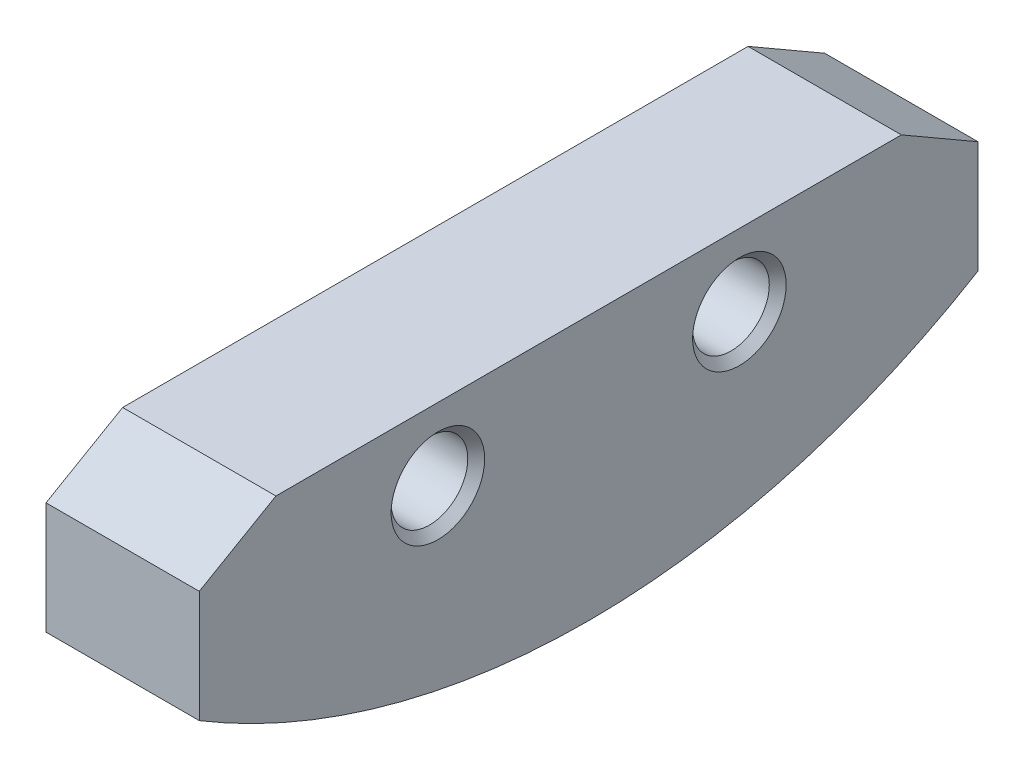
from build123d import *

# Parameters (mm, degrees)
SKETCH1_R                       = 24.625
SKETCH1_R_2                     = 12.5
BOSS_EXTRUDE1_DEPTH             = 2.5
F_3_0_3_DIAMETER_HOLE1_D        = 6.02
CBORE_FOR_M4_SHCS1_D            = 3.05
CBORE_FOR_M4_SHCS1_CBORE_D      = 6
CBORE_FOR_M4_SHCS1_CBORE_DEPTH  = 3.2
CIRPATTERN2_COUNT               = 2
CIRPATTERN2_ANGLE               = 60
CUT_EXTRUDE1_REACH              = 37.182
M3X0_5_TAPPED_HOLE1_D           = 2.5
M3X0_5_TAPPED_HOLE1_DEPTH       = 3.5
M3X0_5_TAPPED_HOLE1_CSINK_D     = 3.05
M3X0_5_TAPPED_HOLE1_CSINK_ANGLE = 90
CUT_EXTRUDE4_REACH              = 33.333
SKETCH22_W                      = 7.779535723
SKETCH22_H                      = 11.158034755
CHAMFER1_SIZE                   = 2.5
CHAMFER1_SIZE2                  = 1.443375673


with BuildPart() as part:
    # Sketch1 → Boss-Extrude1 (new, symmetric)
    with BuildSketch(Plane(origin=(0, 0, 0), x_dir=(0, 0, -1), z_dir=(1, 0, 0))):
        Circle(SKETCH1_R)
        Circle(SKETCH1_R_2, mode=Mode.SUBTRACT)
    extrude(amount=BOSS_EXTRUDE1_DEPTH, both=True)

    # 3.0 _3_ Diameter Hole1 (through all)
    with Locations(Plane(origin=(2.5, 0, 0), x_dir=(0, 0, -1), z_dir=(1, 0, 0))):
        with Locations((13.435028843, 13.435028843)):
            Hole(F_3_0_3_DIAMETER_HOLE1_D / 2)

    # CBORE for M4 SHCS1 (through all)
    with Locations(Plane(origin=(2.5, 0, 0), x_dir=(0, 0, -1), z_dir=(1, 0, 0))):
        with Locations((18.352590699, 4.917561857)):
            cbore_for_m4_shcs1 = CounterBoreHole(CBORE_FOR_M4_SHCS1_D / 2, CBORE_FOR_M4_SHCS1_CBORE_D / 2, CBORE_FOR_M4_SHCS1_CBORE_DEPTH)

    # CirPattern2: CBORE for M4 SHCS1 ×2 about axis
    cirpattern2_axis = Axis((2.5, 0, 0), (1, 0, 0))
    for i in range(1, CIRPATTERN2_COUNT):
        add(cbore_for_m4_shcs1.rotate(cirpattern2_axis, i * CIRPATTERN2_ANGLE / (CIRPATTERN2_COUNT - 1)), mode=Mode.SUBTRACT)

    # Sketch7 → Cut-Extrude1 (cut, up to next)
    with BuildSketch(Plane(origin=(2.5, 0, 0), x_dir=(0, 0, -1), z_dir=(1, 0, 0)), mode=Mode.PRIVATE) as cut_extrude1_sk1:
        with BuildLine():
            Line((-18.718723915, -16), (18.718723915, -16))
            ThreePointArc((18.718723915, -16), (0, 24.625), (-18.718723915, -16))
        make_face()
    cut_extrude1_tool1 = extrude(cut_extrude1_sk1.sketch, amount=-CUT_EXTRUDE1_REACH, mode=Mode.PRIVATE) & part.part
    add(cut_extrude1_tool1.solids().sort_by_distance((2.5, 2.601353, 0))[0], mode=Mode.SUBTRACT)

    # M3x0.5 Tapped Hole1
    with Locations(Plane(origin=(2.5, 0, 0), x_dir=(0, 0, -1), z_dir=(1, 0, 0))):
        with Locations((4.9175, -18.352607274)):
            m3x0_5_tapped_hole1 = CounterSinkHole(M3X0_5_TAPPED_HOLE1_D / 2, M3X0_5_TAPPED_HOLE1_CSINK_D / 2, depth=M3X0_5_TAPPED_HOLE1_DEPTH, counter_sink_angle=M3X0_5_TAPPED_HOLE1_CSINK_ANGLE)

    # Mirror2: M3x0.5 Tapped Hole1 across plane
    add(m3x0_5_tapped_hole1.mirror(Plane.XY), mode=Mode.SUBTRACT)

    # Sketch22 → Cut-Extrude4 (cut, up to next)
    with BuildSketch(Plane(origin=(2.5, 0, 0), x_dir=(0, 0, -1), z_dir=(1, 0, 0)), mode=Mode.PRIVATE) as cut_extrude4_sk1:
        with Locations((-16.589767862, -18.470700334)):
            Rectangle(SKETCH22_W, SKETCH22_H)
    cut_extrude4_tool1 = extrude(cut_extrude4_sk1.sketch, amount=-CUT_EXTRUDE4_REACH, mode=Mode.PRIVATE) & part.part
    cut_extrude4 = cut_extrude4_tool1.solids().sort_by_distance((2.5, -18.4707, 16.589768))[0]
    add(cut_extrude4, mode=Mode.SUBTRACT)

    # Mirror5: Cut-Extrude4 across plane
    add(cut_extrude4.mirror(Plane.XY), mode=Mode.SUBTRACT)

    # Chamfer1
    chamfer1_edges = [part.edges().sort_by_distance(p)[0] for p in [
        (0, -16, 12.7),
        (0, -16, -12.7),
    ]]
    chamfer1_side = [part.faces().sort_by_distance(p)[0] for p in [
        (0, -16, 0),
    ]]
    chamfer(chamfer1_edges, length=CHAMFER1_SIZE, length2=CHAMFER1_SIZE2, reference=chamfer1_side[0])


solid = part.part
